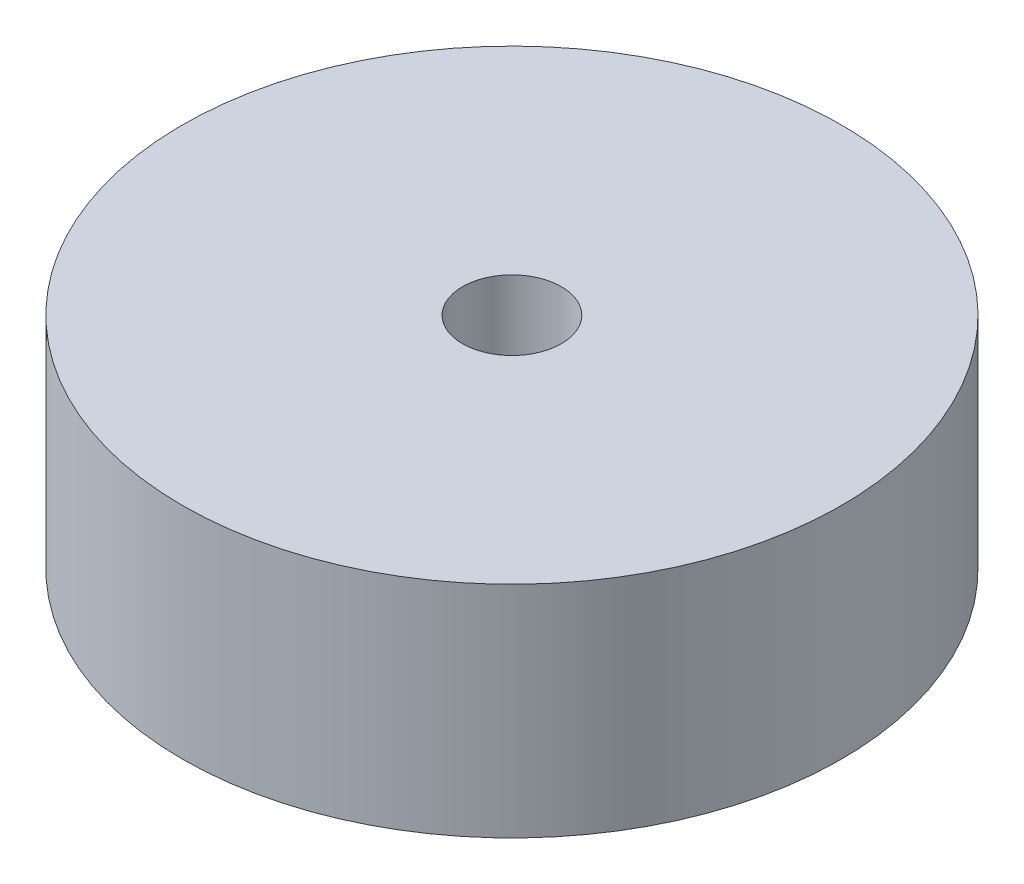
from build123d import *

# Parameters (mm, degrees)
SKETCH1_R      = 15
SKETCH1_R_2    = 2.25
EXTRUDE1_DEPTH = 10


with BuildPart() as part:
    # Sketch1 → Extrude1 (new body)
    with BuildSketch(Plane(origin=(0, 0, 0), x_dir=(1, 0, 0), z_dir=(0, 1, 0))):
        with Locations(Location((0, 0, 0), (0, 0, 270))):
            Circle(SKETCH1_R)
        with Locations(Location((0, 0, 0), (0, 0, 270))):
            Circle(SKETCH1_R_2, mode=Mode.SUBTRACT)
    extrude(amount=EXTRUDE1_DEPTH)


solid = part.part
